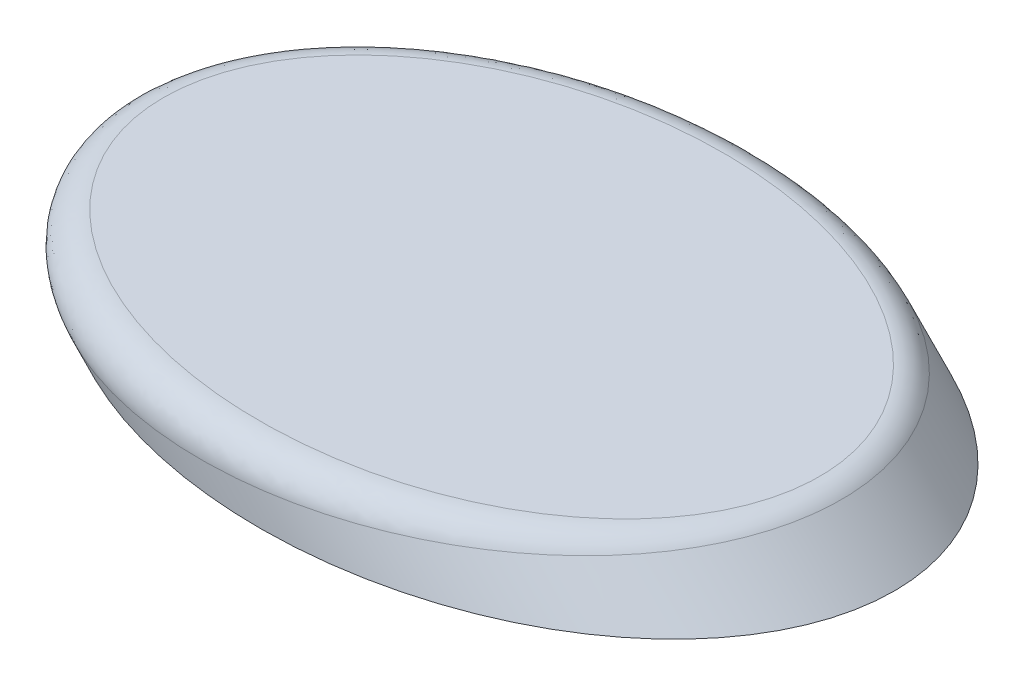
ISO-10303-21;
HEADER;
FILE_DESCRIPTION(('STEP AP214'),'2;1');
FILE_NAME('part.step','',(''),(''),'','','');
FILE_SCHEMA(('AUTOMOTIVE_DESIGN { 1 0 10303 214 1 1 1 1 }'));
ENDSEC;
DATA;
#1=APPLICATION_CONTEXT('core data for automotive mechanical design processes');
#2=APPLICATION_PROTOCOL_DEFINITION('international standard','automotive_design',2000,#1);
#3=PRODUCT_CONTEXT('',#1,'mechanical');
#4=PRODUCT('Part','Part','',(#3));
#5=PRODUCT_RELATED_PRODUCT_CATEGORY('part','',(#4));
#6=PRODUCT_DEFINITION_FORMATION('','',#4);
#7=PRODUCT_DEFINITION_CONTEXT('part definition',#1,'design');
#8=PRODUCT_DEFINITION('design','',#6,#7);
#9=PRODUCT_DEFINITION_SHAPE('','',#8);
#10=(LENGTH_UNIT() NAMED_UNIT(*) SI_UNIT(.MILLI.,.METRE.));
#11=(NAMED_UNIT(*) PLANE_ANGLE_UNIT() SI_UNIT($,.RADIAN.));
#12=(NAMED_UNIT(*) SI_UNIT($,.STERADIAN.) SOLID_ANGLE_UNIT());
#13=UNCERTAINTY_MEASURE_WITH_UNIT(LENGTH_MEASURE(1.E-05),#10,'distance_accuracy_value','');
#14=(GEOMETRIC_REPRESENTATION_CONTEXT(3) GLOBAL_UNCERTAINTY_ASSIGNED_CONTEXT((#13)) GLOBAL_UNIT_ASSIGNED_CONTEXT((#10,
#11,#12)) REPRESENTATION_CONTEXT('',''));
#15=CARTESIAN_POINT('',(0.,0.,0.));
#16=DIRECTION('',(0.,0.,1.));
#17=DIRECTION('',(1.,0.,0.));
#18=AXIS2_PLACEMENT_3D('',#15,#16,#17);
#19=CARTESIAN_POINT('',(0.,-6.35,0.));
#20=DIRECTION('',(0.,-1.,0.));
#21=DIRECTION('',(0.,0.,-1.));
#22=AXIS2_PLACEMENT_3D('',#19,#20,#21);
#23=PLANE('',#22);
#24=CARTESIAN_POINT('',(6.34999999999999,-6.35,0.));
#25=DIRECTION('',(0.,-1.,0.));
#26=DIRECTION('',(-1.,0.,0.));
#27=AXIS2_PLACEMENT_3D('',#24,#25,#26);
#28=ELLIPSE('',#27,38.1660885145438,26.9875);
#29=CARTESIAN_POINT('',(-31.8160885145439,-6.35,0.));
#30=VERTEX_POINT('',#29);
#31=EDGE_CURVE('E44',#30,#30,#28,.T.);
#32=ORIENTED_EDGE('',*,*,#31,.T.);
#33=EDGE_LOOP('',(#32));
#34=FACE_BOUND('',#33,.T.);
#35=ADVANCED_FACE('F31',(#34),#23,.T.);
#36=CARTESIAN_POINT('',(41.2749999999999,-41.275,0.));
#37=DIRECTION('',(-0.707106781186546,0.707106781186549,0.));
#38=DIRECTION('',(-0.707106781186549,-0.707106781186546,0.));
#39=AXIS2_PLACEMENT_3D('',#36,#37,#38);
#40=CYLINDRICAL_SURFACE('',#39,26.9875);
#41=CARTESIAN_POINT('',(3.175,-3.175,0.));
#42=DIRECTION('',(-0.0623782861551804,0.998052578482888,0.));
#43=DIRECTION('',(-0.998052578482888,-0.0623782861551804,0.));
#44=AXIS2_PLACEMENT_3D('',#41,#42,#43);
#45=ELLIPSE('',#44,35.9911143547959,26.9875);
#46=CARTESIAN_POINT('',(-32.7460244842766,-5.42006403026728,0.));
#47=VERTEX_POINT('',#46);
#48=EDGE_CURVE('E40',#47,#47,#45,.F.);
#49=ORIENTED_EDGE('',*,*,#48,.T.);
#50=EDGE_LOOP('',(#49));
#51=FACE_BOUND('',#50,.T.);
#52=ORIENTED_EDGE('',*,*,#31,.F.);
#53=EDGE_LOOP('',(#52));
#54=FACE_BOUND('',#53,.T.);
#55=ADVANCED_FACE('F51',(#51,#54),#40,.T.);
#56=CARTESIAN_POINT('',(0.,0.,0.));
#57=DIRECTION('',(0.,-1.,0.));
#58=DIRECTION('',(0.,0.,-1.));
#59=AXIS2_PLACEMENT_3D('',#56,#57,#58);
#60=PLANE('',#59);
#61=CARTESIAN_POINT('',(3.175,0.,0.));
#62=DIRECTION('',(0.,-1.,0.));
#63=DIRECTION('',(-1.,0.,0.));
#64=AXIS2_PLACEMENT_3D('',#61,#62,#63);
#65=ELLIPSE('',#64,33.6759604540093,23.8125);
#66=CARTESIAN_POINT('',(-30.5009604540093,0.,0.));
#67=VERTEX_POINT('',#66);
#68=EDGE_CURVE('E11',#67,#67,#65,.F.);
#69=ORIENTED_EDGE('',*,*,#68,.T.);
#70=EDGE_LOOP('',(#69));
#71=FACE_BOUND('',#70,.T.);
#72=ADVANCED_FACE('F53',(#71),#60,.F.);
#73=CARTESIAN_POINT('',(-30.5009604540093,0.,0.));
#74=CARTESIAN_POINT('',(-32.6224276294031,0.,0.));
#75=CARTESIAN_POINT('',(-33.4342779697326,-1.95998010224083,0.));
#76=CARTESIAN_POINT('',(-34.2461283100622,-3.91996020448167,0.));
#77=CARTESIAN_POINT('',(-32.7460244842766,-5.42006403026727,0.));
#78=CARTESIAN_POINT('',(-30.5009604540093,0.,-0.520980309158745));
#79=CARTESIAN_POINT('',(-32.6224276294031,0.,-0.586619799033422));
#80=CARTESIAN_POINT('',(-33.4342779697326,-1.95998010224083,-0.61173825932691));
#81=CARTESIAN_POINT('',(-34.2461283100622,-3.91996020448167,-0.636858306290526));
#82=CARTESIAN_POINT('',(-32.7460244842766,-5.42006403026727,-0.590444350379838));
#83=CARTESIAN_POINT('',(-30.4767371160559,0.,-1.04196061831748));
#84=CARTESIAN_POINT('',(-32.594325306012,0.,-1.17309843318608));
#85=CARTESIAN_POINT('',(-33.4053822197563,-1.95892374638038,-1.22347651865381));
#86=CARTESIAN_POINT('',(-34.2164669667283,-3.91784851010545,-1.27356335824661));
#87=CARTESIAN_POINT('',(-32.7201862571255,-5.41844914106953,-1.18088870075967));
#88=CARTESIAN_POINT('',(-30.3803663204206,0.,-2.07945714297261));
#89=CARTESIAN_POINT('',(-32.4826425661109,0.,-2.3400200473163));
#90=CARTESIAN_POINT('',(-33.2906069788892,-1.95473751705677,-2.4403125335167));
#91=CARTESIAN_POINT('',(-34.0985982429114,-3.90947601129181,-2.54031650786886));
#92=CARTESIAN_POINT('',(-32.6173907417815,-5.41202442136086,-2.35671809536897));
#93=CARTESIAN_POINT('',(-30.3082180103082,0.,-2.59597327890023));
#94=CARTESIAN_POINT('',(-32.399113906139,0.,-2.92019072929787));
#95=CARTESIAN_POINT('',(-33.2047264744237,-1.95160760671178,-3.04541017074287));
#96=CARTESIAN_POINT('',(-34.0104454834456,-3.90321908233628,-3.17006906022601));
#97=CARTESIAN_POINT('',(-32.5404325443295,-5.40721453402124,-2.94210304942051));
#98=CARTESIAN_POINT('',(-30.1159168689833,0.,-3.62882826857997));
#99=CARTESIAN_POINT('',(-32.1769284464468,0.,-4.07814235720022));
#100=CARTESIAN_POINT('',(-32.9764059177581,-1.94331776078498,-4.25274614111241));
#101=CARTESIAN_POINT('',(-33.7759919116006,-3.88663945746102,-4.42677373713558));
#102=CARTESIAN_POINT('',(-32.3353113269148,-5.3943944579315,-4.11267203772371));
#103=CARTESIAN_POINT('',(-29.9949879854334,0.,-4.1450222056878));
#104=CARTESIAN_POINT('',(-32.0374817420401,0.,-4.65547930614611));
#105=CARTESIAN_POINT('',(-32.8330517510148,-1.9381250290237,-4.8547707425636));
#106=CARTESIAN_POINT('',(-33.6288579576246,-3.87625857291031,-5.05324074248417));
#107=CARTESIAN_POINT('',(-32.2063205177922,-5.38633253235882,-4.69769183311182));
#108=CARTESIAN_POINT('',(-29.7076069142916,0.,-5.164541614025));
#109=CARTESIAN_POINT('',(-31.7070299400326,0.,-5.79258191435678));
#110=CARTESIAN_POINT('',(-32.4935260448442,-1.92589077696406,-6.04010029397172));
#111=CARTESIAN_POINT('',(-33.2802560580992,-3.85178997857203,-6.2867989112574));
#112=CARTESIAN_POINT('',(-31.8997807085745,-5.36717379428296,-5.85314716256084));
#113=CARTESIAN_POINT('',(-29.5411526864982,0.,-5.66786650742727));
#114=CARTESIAN_POINT('',(-31.5161623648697,0.,-6.35213521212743));
#115=CARTESIAN_POINT('',(-32.2973521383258,-1.91884917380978,-6.62340440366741));
#116=CARTESIAN_POINT('',(-33.0789331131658,-3.83771230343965,-6.89366011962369));
#117=CARTESIAN_POINT('',(-31.7222295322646,-5.35607684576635,-6.42358204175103));
#118=CARTESIAN_POINT('',(-29.1600292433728,0.,-6.67363826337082));
#119=CARTESIAN_POINT('',(-31.0806351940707,0.,-7.46637156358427));
#120=CARTESIAN_POINT('',(-31.8499402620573,-1.90289387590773,-7.78457186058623));
#121=CARTESIAN_POINT('',(-32.6196583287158,-3.80580247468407,-8.10169844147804));
#122=CARTESIAN_POINT('',(-31.3156978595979,-5.33066861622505,-7.56345669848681));
#123=CARTESIAN_POINT('',(-28.9440333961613,0.,-7.17558101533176));
#124=CARTESIAN_POINT('',(-30.8346620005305,0.,-8.02023287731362));
#125=CARTESIAN_POINT('',(-31.5971929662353,-1.89392921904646,-8.36171481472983));
#126=CARTESIAN_POINT('',(-32.3603240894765,-3.78787955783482,-8.70197278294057));
#127=CARTESIAN_POINT('',(-31.0853022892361,-5.31626889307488,-8.13232515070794));
#128=CARTESIAN_POINT('',(-28.4707577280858,0.,-8.15955287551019));
#129=CARTESIAN_POINT('',(-30.2977851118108,0.,-9.10160371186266));
#130=CARTESIAN_POINT('',(-31.045818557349,-1.87452682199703,-9.48814415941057));
#131=CARTESIAN_POINT('',(-31.7944496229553,-3.74907467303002,-9.87346158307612));
#132=CARTESIAN_POINT('',(-30.5804749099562,-5.28471718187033,-9.24749325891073));
#133=CARTESIAN_POINT('',(-28.2134756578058,0.,-8.64158089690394));
#134=CARTESIAN_POINT('',(-30.0070627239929,0.,-9.62899497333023));
#135=CARTESIAN_POINT('',(-30.7471889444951,-1.86408900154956,-10.0374290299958));
#136=CARTESIAN_POINT('',(-31.4881001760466,-3.72820520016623,-10.4445490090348));
#137=CARTESIAN_POINT('',(-30.3060407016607,-5.26756504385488,-9.79379168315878));
#138=CARTESIAN_POINT('',(-27.6503847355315,0.,-9.60283857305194));
#139=CARTESIAN_POINT('',(-29.3733750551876,0.,-10.6761423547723));
#140=CARTESIAN_POINT('',(-30.096549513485,-1.84154912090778,-11.1277223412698));
#141=CARTESIAN_POINT('',(-30.8205700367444,-3.68312754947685,-11.5778831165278));
#142=CARTESIAN_POINT('',(-29.7054103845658,-5.23002564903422,-10.8832170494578));
#143=CARTESIAN_POINT('',(-27.3430300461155,0.,-10.0811604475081));
#144=CARTESIAN_POINT('',(-29.0289322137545,0.,-11.1947031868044));
#145=CARTESIAN_POINT('',(-29.7428649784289,-1.82939670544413,-11.6674898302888));
#146=CARTESIAN_POINT('',(-30.4578406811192,-3.65882888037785,-12.1388137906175));
#147=CARTESIAN_POINT('',(-29.3775653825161,-5.20953533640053,-11.4253151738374));
#148=CARTESIAN_POINT('',(-26.6921881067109,0.,-11.0127566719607));
#149=CARTESIAN_POINT('',(-28.3025978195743,0.,-12.2000505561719));
#150=CARTESIAN_POINT('',(-28.9973940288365,-1.80404073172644,-12.7135808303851));
#151=CARTESIAN_POINT('',(-29.6932321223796,-3.60811690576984,-13.2256482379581));
#152=CARTESIAN_POINT('',(-28.6833339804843,-5.16614587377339,-12.4811242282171));
#153=CARTESIAN_POINT('',(-26.3486848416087,0.,-11.4660197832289));
#154=CARTESIAN_POINT('',(-27.9208726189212,0.,-12.6868030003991));
#155=CARTESIAN_POINT('',(-28.6055907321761,-1.79083670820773,-13.2198893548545));
#156=CARTESIAN_POINT('',(-29.2915273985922,-3.58171404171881,-13.7515167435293));
#157=CARTESIAN_POINT('',(-28.3169304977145,-5.14324565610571,-12.9948224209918));
#158=CARTESIAN_POINT('',(-25.6132999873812,0.,-12.3666757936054));
#159=CARTESIAN_POINT('',(-27.1070081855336,0.,-13.6495395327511));
#160=CARTESIAN_POINT('',(-27.7705455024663,-1.76299682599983,-14.2210234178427));
#161=CARTESIAN_POINT('',(-28.4354071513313,-3.52603780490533,-14.7909175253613));
#162=CARTESIAN_POINT('',(-27.5325199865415,-5.09421999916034,-14.0155658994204));
#163=CARTESIAN_POINT('',(-25.2199219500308,0.,-12.8128454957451));
#164=CARTESIAN_POINT('',(-26.6734809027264,0.,-14.1240955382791));
#165=CARTESIAN_POINT('',(-27.3257683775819,-1.74832306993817,-14.714256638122));
#166=CARTESIAN_POINT('',(-27.9795454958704,-3.49669469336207,-15.3028770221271));
#167=CARTESIAN_POINT('',(-27.1129167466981,-5.06799479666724,-14.5212248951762));
#168=CARTESIAN_POINT('',(-24.4028107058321,0.,-13.6761564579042));
#169=CARTESIAN_POINT('',(-25.7765428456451,0.,-15.0380646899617));
#170=CARTESIAN_POINT('',(-26.4059261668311,-1.71833021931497,-15.6638639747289));
#171=CARTESIAN_POINT('',(-27.0368077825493,-3.43670931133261,-16.2881193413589));
#172=CARTESIAN_POINT('',(-26.2413314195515,-5.01352071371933,-15.4996439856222));
#173=CARTESIAN_POINT('',(-23.9790793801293,0.,-14.0932995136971));
#174=CARTESIAN_POINT('',(-25.3132863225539,0.,-15.4775370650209));
#175=CARTESIAN_POINT('',(-25.9308629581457,-1.70301116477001,-16.1202403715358));
#176=CARTESIAN_POINT('',(-26.5500925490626,-3.4060750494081,-16.7614686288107));
#177=CARTESIAN_POINT('',(-25.7893513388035,-4.98527195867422,-15.9724061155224));
#178=CARTESIAN_POINT('',(-22.6270452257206,0.,-15.3392117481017));
#179=CARTESIAN_POINT('',(-23.8432069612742,0.,-16.7819268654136));
#180=CARTESIAN_POINT('',(-24.4212041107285,-1.65491855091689,-17.4767569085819));
#181=CARTESIAN_POINT('',(-25.0062598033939,-3.31006183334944,-18.1652231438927));
#182=CARTESIAN_POINT('',(-24.3471815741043,-4.89513634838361,-17.384439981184));
#183=CARTESIAN_POINT('',(-21.6534065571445,0.,-16.1196073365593));
#184=CARTESIAN_POINT('',(-22.7908790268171,0.,-17.5924116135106));
#185=CARTESIAN_POINT('',(-23.3425172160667,-1.62136623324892,-18.3167860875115));
#186=CARTESIAN_POINT('',(-23.9020788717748,-3.24297230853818,-19.0357179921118));
#187=CARTESIAN_POINT('',(-23.3086336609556,-4.83022710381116,-18.2688883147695));
#188=CARTESIAN_POINT('',(-20.1066976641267,0.,-17.2133238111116));
#189=CARTESIAN_POINT('',(-21.1267729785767,0.,-18.7204277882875));
#190=CARTESIAN_POINT('',(-21.6411069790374,-1.56980518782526,-19.483407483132));
#191=CARTESIAN_POINT('',(-22.1576332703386,-3.13967695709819,-20.2448889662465));
#192=CARTESIAN_POINT('',(-21.6588108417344,-4.72711317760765,-19.508433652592));
#193=CARTESIAN_POINT('',(-19.5643563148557,0.,-17.5717353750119));
#194=CARTESIAN_POINT('',(-20.5461775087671,0.,-19.0877456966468));
#195=CARTESIAN_POINT('',(-21.0466133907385,-1.55202467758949,-19.8636314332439));
#196=CARTESIAN_POINT('',(-21.5492911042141,-3.10411557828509,-20.6381743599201));
#197=CARTESIAN_POINT('',(-21.0803134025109,-4.69095708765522,-19.9146334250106));
#198=CARTESIAN_POINT('',(-18.4594481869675,0.,-18.2559545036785));
#199=CARTESIAN_POINT('',(-19.3668072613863,0.,-19.7858021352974));
#200=CARTESIAN_POINT('',(-19.8393621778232,-1.51639114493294,-20.5859284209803));
#201=CARTESIAN_POINT('',(-20.3141416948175,-3.03284789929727,-21.3847252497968));
#202=CARTESIAN_POINT('',(-19.9017447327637,-4.61729654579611,-20.6900817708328));
#203=CARTESIAN_POINT('',(-17.896882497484,0.,-18.5817638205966));
#204=CARTESIAN_POINT('',(-18.768097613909,0.,-20.1166791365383));
#205=CARTESIAN_POINT('',(-19.2266055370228,-1.49853812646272,-20.9280035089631));
#206=CARTESIAN_POINT('',(-19.6874005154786,-2.99714196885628,-21.7381421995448));
#207=CARTESIAN_POINT('',(-19.3016746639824,-4.57979216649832,-21.0593323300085));
#208=CARTESIAN_POINT('',(-16.1384770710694,0.,-19.5358706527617));
#209=CARTESIAN_POINT('',(-16.9052438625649,0.,-21.0793811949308));
#210=CARTESIAN_POINT('',(-17.3168565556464,-1.44362046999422,-21.9248179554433));
#211=CARTESIAN_POINT('',(-17.7382293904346,-2.88752171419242,-22.7651436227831));
#212=CARTESIAN_POINT('',(-17.426042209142,-4.46256513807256,-22.1406534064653));
#213=CARTESIAN_POINT('',(-14.9137949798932,0.,-20.1115784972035));
#214=CARTESIAN_POINT('',(-15.612220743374,0.,-21.6559134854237));
#215=CARTESIAN_POINT('',(-15.9944190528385,-1.40659502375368,-22.5190318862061));
#216=CARTESIAN_POINT('',(-16.3865296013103,-2.81346032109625,-23.3783016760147));
#217=CARTESIAN_POINT('',(-16.1197146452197,-4.38091966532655,-22.7931222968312));
#218=CARTESIAN_POINT('',(-12.3710430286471,0.,-21.1496698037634));
#219=CARTESIAN_POINT('',(-12.9393079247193,0.,-22.6847436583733));
#220=CARTESIAN_POINT('',(-13.2618041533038,-1.3320509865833,-23.5789789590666));
#221=CARTESIAN_POINT('',(-13.5948422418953,-2.66438967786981,-24.4691290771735));
#222=CARTESIAN_POINT('',(-13.4074458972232,-4.21140286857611,-23.9696257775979));
#223=CARTESIAN_POINT('',(-11.0512266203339,0.,-21.6077052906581));
#224=CARTESIAN_POINT('',(-11.5576560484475,0.,-23.1337001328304));
#225=CARTESIAN_POINT('',(-11.8501715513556,-1.29455620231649,-24.0398458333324));
#226=CARTESIAN_POINT('',(-12.1530763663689,-2.58938149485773,-24.9431596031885));
#227=CARTESIAN_POINT('',(-11.999641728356,-4.12341510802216,-24.4887326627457));
#228=CARTESIAN_POINT('',(-8.33941923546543,0.,-22.4019624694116));
#229=CARTESIAN_POINT('',(-8.72891856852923,0.,-23.9012061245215));
#230=CARTESIAN_POINT('',(-8.96091750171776,-1.21971516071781,-24.8269849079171));
#231=CARTESIAN_POINT('',(-9.20375895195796,-2.43971120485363,-25.749811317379));
#232=CARTESIAN_POINT('',(-9.10704718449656,-3.94262794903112,-25.3888907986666));
#233=CARTESIAN_POINT('',(-6.94644728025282,0.,-22.7348153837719));
#234=CARTESIAN_POINT('',(-7.28059878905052,0.,-24.2174369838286));
#235=CARTESIAN_POINT('',(-7.48252987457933,-1.1823965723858,-25.1495637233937));
#236=CARTESIAN_POINT('',(-7.69496427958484,-2.36505200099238,-26.0799176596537));
#237=CARTESIAN_POINT('',(-7.6212104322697,-3.84976315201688,-25.7661241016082));
#238=CARTESIAN_POINT('',(-4.11153658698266,0.,-23.2719448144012));
#239=CARTESIAN_POINT('',(-4.34158919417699,0.,-24.7146066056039));
#240=CARTESIAN_POINT('',(-4.48320671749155,-1.10847045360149,-25.6553134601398));
#241=CARTESIAN_POINT('',(-4.6356234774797,-2.21720710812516,-26.5942010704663));
#242=CARTESIAN_POINT('',(-4.59730569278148,-3.66076910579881,-26.3748707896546));
#243=CARTESIAN_POINT('',(-2.6691678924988,0.,-23.4739310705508));
#244=CARTESIAN_POINT('',(-2.85004762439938,0.,-24.8942775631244));
#245=CARTESIAN_POINT('',(-2.96197558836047,-1.07188591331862,-25.83601233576));
#246=CARTESIAN_POINT('',(-3.08421404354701,-2.14401429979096,-26.7770074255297));
#247=CARTESIAN_POINT('',(-3.05877908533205,-3.56461119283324,-26.6037885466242));
#248=CARTESIAN_POINT('',(0.240396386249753,0.,-23.7447864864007));
#249=CARTESIAN_POINT('',(0.151610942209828,0.,-25.1152596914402));
#250=CARTESIAN_POINT('',(0.0988697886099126,-0.999904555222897,-26.0550469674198));
#251=CARTESIAN_POINT('',(0.0357087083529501,-2.00005415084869,-26.9940904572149));
#252=CARTESIAN_POINT('',(0.0447561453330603,-3.37064024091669,-26.9107580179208));
#253=CARTESIAN_POINT('',(1.70769880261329,0.,-23.8124996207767));
#254=CARTESIAN_POINT('',(1.66235509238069,0.,-25.1563701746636));
#255=CARTESIAN_POINT('',(1.63852983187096,-0.964520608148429,-26.0921489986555));
#256=CARTESIAN_POINT('',(1.60486999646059,-1.92926259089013,-27.0281477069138));
#257=CARTESIAN_POINT('',(1.6098787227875,-3.27282007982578,-26.9874995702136));
#258=CARTESIAN_POINT('',(4.6423011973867,0.,-23.8125003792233));
#259=CARTESIAN_POINT('',(4.67802363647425,0.,-25.0990687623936));
#260=CARTESIAN_POINT('',(4.71147016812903,-0.895351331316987,-26.0229790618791));
#261=CARTESIAN_POINT('',(4.73514309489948,-1.79092265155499,-26.9471108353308));
#262=CARTESIAN_POINT('',(4.74012127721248,-3.07717992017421,-26.9875004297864));
#263=CARTESIAN_POINT('',(6.10960117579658,0.,-23.7447880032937));
#264=CARTESIAN_POINT('',(6.18351833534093,0.,-25.0015314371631));
#265=CARTESIAN_POINT('',(6.24475046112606,-0.861566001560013,-25.9167070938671));
#266=CARTESIAN_POINT('',(6.2968596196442,-1.72332923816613,-26.8329481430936));
#267=CARTESIAN_POINT('',(6.30524125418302,-2.97935992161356,-26.9107597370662));
#268=CARTESIAN_POINT('',(9.0191703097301,0.,-23.4739295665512));
#269=CARTESIAN_POINT('',(9.16411153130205,0.,-24.6678080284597));
#270=CARTESIAN_POINT('',(9.28001017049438,-0.795948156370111,-25.5618543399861));
#271=CARTESIAN_POINT('',(9.38699460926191,-1.59208901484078,-26.4569439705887));
#272=CARTESIAN_POINT('',(9.40878166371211,-2.78538864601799,-26.6037868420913));
#273=CARTESIAN_POINT('',(10.4615462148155,0.,-23.2719395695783));
#274=CARTESIAN_POINT('',(10.6399068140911,0.,-24.4335713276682));
#275=CARTESIAN_POINT('',(10.7821448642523,-0.764101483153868,-25.3144908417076));
#276=CARTESIAN_POINT('',(10.9161609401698,-1.52837429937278,-26.1971770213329));
#277=CARTESIAN_POINT('',(10.9473159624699,-2.68923025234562,-26.3748648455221));
#278=CARTESIAN_POINT('',(13.2964378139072,0.,-22.7348205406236));
#279=CARTESIAN_POINT('',(13.5366987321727,0.,-23.8294223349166));
#280=CARTESIAN_POINT('',(13.7303991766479,-0.702668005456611,-24.680652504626));
#281=CARTESIAN_POINT('',(13.9161962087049,-1.40550068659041,-25.5335827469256));
#282=CARTESIAN_POINT('',(13.9712003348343,-2.50023747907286,-25.7661299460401));
#283=CARTESIAN_POINT('',(14.6893840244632,0.,-22.4019814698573));
#284=CARTESIAN_POINT('',(14.9587227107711,0.,-23.4625162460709));
#285=CARTESIAN_POINT('',(15.1770357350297,-0.673052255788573,-24.2965805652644));
#286=CARTESIAN_POINT('',(15.3881629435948,-1.34624936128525,-25.132948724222));
#287=CARTESIAN_POINT('',(15.457009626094,-2.40737439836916,-25.3889123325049));
#288=CARTESIAN_POINT('',(17.4012609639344,0.,-21.6076867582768));
#289=CARTESIAN_POINT('',(17.7241990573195,0.,-22.5980719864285));
#290=CARTESIAN_POINT('',(17.9902475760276,-0.616346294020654,-23.3946181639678));
#291=CARTESIAN_POINT('',(18.2494986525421,-1.23282959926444,-24.1933437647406));
#292=CARTESIAN_POINT('',(18.34967836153,-2.22658260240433,-24.4887116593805));
#293=CARTESIAN_POINT('',(18.7211697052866,0.,-21.1496014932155));
#294=CARTESIAN_POINT('',(19.0692321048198,0.,-22.1045461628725));
#295=CARTESIAN_POINT('',(19.3579172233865,-0.589211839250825,-22.8802573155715));
#296=CARTESIAN_POINT('',(19.6405409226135,-1.17854231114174,-23.6586279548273));
#297=CARTESIAN_POINT('',(19.7575810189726,-2.13858868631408,-23.9695483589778));
#298=CARTESIAN_POINT('',(21.2636723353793,0.,-20.1116446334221));
#299=CARTESIAN_POINT('',(21.6577409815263,0.,-20.9941128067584));
#300=CARTESIAN_POINT('',(21.9899841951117,-0.537702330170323,-21.7252301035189));
#301=CARTESIAN_POINT('',(22.3165704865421,-1.07551535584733,-22.4588302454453));
#302=CARTESIAN_POINT('',(22.4695838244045,-1.96908851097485,-22.7931972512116));
#303=CARTESIAN_POINT('',(22.4880264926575,0.,-19.5361136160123));
#304=CARTESIAN_POINT('',(22.9035943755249,0.,-20.382108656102));
#305=CARTESIAN_POINT('',(23.2562830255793,-0.513266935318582,-21.089105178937));
#306=CARTESIAN_POINT('',(23.6040534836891,-1.02662764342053,-21.7989418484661));
#307=CARTESIAN_POINT('',(23.7755615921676,-1.88746490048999,-22.1409287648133));
#308=CARTESIAN_POINT('',(24.8181040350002,0.,-18.2718217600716));
#309=CARTESIAN_POINT('',(25.2727072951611,0.,-19.0435881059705));
#310=CARTESIAN_POINT('',(25.6643803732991,-0.467347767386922,-19.6996848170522));
#311=CARTESIAN_POINT('',(26.0515319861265,-0.93478176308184,-20.3583879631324));
#312=CARTESIAN_POINT('',(26.260977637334,-1.73212639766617,-20.7080646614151));
#313=CARTESIAN_POINT('',(25.926567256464,0.,-17.5881937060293));
#314=CARTESIAN_POINT('',(26.399341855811,0.,-18.3226789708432));
#315=CARTESIAN_POINT('',(26.8090811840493,-0.445787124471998,-18.9517593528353));
#316=CARTESIAN_POINT('',(27.2150484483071,-0.891644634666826,-19.5836564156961));
#317=CARTESIAN_POINT('',(27.4433384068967,-1.65822884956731,-19.9332862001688));
#318=CARTESIAN_POINT('',(27.4956166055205,0.,-16.4786775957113));
#319=CARTESIAN_POINT('',(27.9942867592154,0.,-17.1551760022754));
#320=CARTESIAN_POINT('',(28.4284580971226,-0.415590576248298,-17.7425966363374));
#321=CARTESIAN_POINT('',(28.8617607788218,-0.831197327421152,-18.3306658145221));
#322=CARTESIAN_POINT('',(29.1169910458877,-1.5536255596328,-18.6758346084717));
#323=CARTESIAN_POINT('',(27.9928307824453,0.,-16.1041017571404));
#324=CARTESIAN_POINT('',(28.4991811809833,0.,-16.7619081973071));
#325=CARTESIAN_POINT('',(28.9414637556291,-0.406073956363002,-17.3350450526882));
#326=CARTESIAN_POINT('',(29.3829708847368,-0.81216223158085,-17.9088382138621));
#327=CARTESIAN_POINT('',(29.647352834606,-1.52047794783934,-18.2513153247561));
#328=CARTESIAN_POINT('',(28.9621053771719,0.,-15.3237655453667));
#329=CARTESIAN_POINT('',(29.4831384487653,0.,-15.9436407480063));
#330=CARTESIAN_POINT('',(29.9412572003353,-0.387611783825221,-16.4872987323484));
#331=CARTESIAN_POINT('',(30.3986010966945,-0.77523787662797,-17.0316149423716));
#332=CARTESIAN_POINT('',(30.6812457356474,-1.45585964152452,-17.3669342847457));
#333=CARTESIAN_POINT('',(29.4341643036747,0.,-14.9180033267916));
#334=CARTESIAN_POINT('',(29.9622887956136,0.,-15.5186475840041));
#335=CARTESIAN_POINT('',(30.4280434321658,-0.378666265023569,-16.0471020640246));
#336=CARTESIAN_POINT('',(30.8931117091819,-0.757345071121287,-16.5762255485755));
#337=CARTESIAN_POINT('',(31.1847752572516,-1.42438904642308,-16.907070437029));
#338=CARTESIAN_POINT('',(30.7658460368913,0.,-13.6907555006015));
#339=CARTESIAN_POINT('',(31.312726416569,0.,-14.2354194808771));
#340=CARTESIAN_POINT('',(31.8009414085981,-0.353543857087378,-14.71745041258));
#341=CARTESIAN_POINT('',(32.2866841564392,-0.70713298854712,-15.2018675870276));
#342=CARTESIAN_POINT('',(32.6052357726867,-1.33561026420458,-15.5161895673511));
#343=CARTESIAN_POINT('',(31.5876856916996,0.,-12.8266683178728));
#344=CARTESIAN_POINT('',(32.1467012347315,0.,-13.3329393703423));
#345=CARTESIAN_POINT('',(32.6477916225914,-0.338185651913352,-13.7833647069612));
#346=CARTESIAN_POINT('',(33.1470956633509,-0.676403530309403,-14.2360767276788));
#347=CARTESIAN_POINT('',(33.4818647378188,-1.28082095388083,-14.53689076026));
#348=CARTESIAN_POINT('',(32.6987662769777,0.,-11.4659380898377));
#349=CARTESIAN_POINT('',(33.2741117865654,0.,-11.9131606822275));
#350=CARTESIAN_POINT('',(33.7922879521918,-0.317561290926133,-12.3152029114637));
#351=CARTESIAN_POINT('',(34.3100503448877,-0.635130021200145,-12.7177782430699));
#352=CARTESIAN_POINT('',(34.6670173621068,-1.20674891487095,-12.9947298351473));
#353=CARTESIAN_POINT('',(33.0422098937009,0.,-11.0127348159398));
#354=CARTESIAN_POINT('',(33.6223835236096,0.,-11.4408749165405));
#355=CARTESIAN_POINT('',(34.1459934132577,-0.311209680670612,-11.8266254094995));
#356=CARTESIAN_POINT('',(34.669269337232,-0.622425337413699,-12.2128767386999));
#357=CARTESIAN_POINT('',(35.03335721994,-1.18385267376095,-12.4810994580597));
#358=CARTESIAN_POINT('',(33.6930082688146,0.,-10.0811822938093));
#359=CARTESIAN_POINT('',(34.2821827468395,0.,-10.470711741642));
#360=CARTESIAN_POINT('',(34.8161361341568,-0.299209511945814,-10.8231123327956));
#361=CARTESIAN_POINT('',(35.349758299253,-0.598424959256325,-11.1760081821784));
#362=CARTESIAN_POINT('',(35.7275421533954,-1.1404661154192,-11.4253399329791));
#363=CARTESIAN_POINT('',(34.0003790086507,0.,-9.60284431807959));
#364=CARTESIAN_POINT('',(34.5938012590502,0.,-9.97281477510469));
#365=CARTESIAN_POINT('',(35.1325898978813,-0.293560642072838,-10.3081885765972));
#366=CARTESIAN_POINT('',(35.6711222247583,-0.587125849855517,-10.6440198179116));
#367=CARTESIAN_POINT('',(36.055404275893,-1.11997473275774,-10.8832235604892));
#368=CARTESIAN_POINT('',(34.563481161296,0.,-8.64157537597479));
#369=CARTESIAN_POINT('',(35.1645722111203,0.,-8.97276327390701));
#370=CARTESIAN_POINT('',(35.7122579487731,-0.283238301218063,-9.27404538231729));
#371=CARTESIAN_POINT('',(36.2597062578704,-0.566480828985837,-9.57575090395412));
#372=CARTESIAN_POINT('',(36.6560465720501,-1.08243458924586,-9.79378542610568));
#373=CARTESIAN_POINT('',(34.8207592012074,0.,-8.15955139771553));
#374=CARTESIAN_POINT('',(35.4253538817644,0.,-8.47150853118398));
#375=CARTESIAN_POINT('',(35.9770674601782,-0.278535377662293,-8.75577700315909));
#376=CARTESIAN_POINT('',(36.5286080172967,-0.557073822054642,-9.04042153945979));
#377=CARTESIAN_POINT('',(36.9304764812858,-1.06528271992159,-9.24749158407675));
#378=CARTESIAN_POINT('',(35.29403192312,0.,-7.17558249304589));
#379=CARTESIAN_POINT('',(35.9049769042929,0.,-7.44873384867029));
#380=CARTESIAN_POINT('',(36.4641452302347,-0.269901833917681,-7.69834388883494));
#381=CARTESIAN_POINT('',(37.0231405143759,-0.539806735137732,-7.9483291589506));
#382=CARTESIAN_POINT('',(37.4353007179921,-1.03373120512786,-8.13232682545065));
#383=CARTESIAN_POINT('',(35.5100288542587,0.,-6.67363865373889));
#384=CARTESIAN_POINT('',(36.1238809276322,0.,-6.9271641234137));
#385=CARTESIAN_POINT('',(36.6864158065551,-0.265971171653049,-7.15918029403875));
#386=CARTESIAN_POINT('',(37.2488358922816,-0.531944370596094,-7.39151282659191));
#387=CARTESIAN_POINT('',(37.6656974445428,-1.01933140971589,-7.56345714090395));
#388=CARTESIAN_POINT('',(35.8911530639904,0.,-5.66786612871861));
#389=CARTESIAN_POINT('',(36.5100644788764,0.,-5.88243904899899));
#390=CARTESIAN_POINT('',(37.0785788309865,-0.259046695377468,-6.07924916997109));
#391=CARTESIAN_POINT('',(37.6469848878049,-0.518095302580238,-6.27635727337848));
#392=CARTESIAN_POINT('',(38.0722299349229,-0.993923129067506,-6.42358161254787));
#393=CARTESIAN_POINT('',(36.057607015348,0.,-5.16454151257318));
#394=CARTESIAN_POINT('',(36.678736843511,0.,-5.35974702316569));
#395=CARTESIAN_POINT('',(37.2498374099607,-0.256028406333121,-5.53901052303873));
#396=CARTESIAN_POINT('',(37.8208750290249,-0.512057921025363,-5.71850752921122));
#397=CARTESIAN_POINT('',(38.2497808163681,-0.982826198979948,-5.85314704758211));
#398=CARTESIAN_POINT('',(36.3449878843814,0.,-4.14502230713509));
#399=CARTESIAN_POINT('',(36.9698970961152,0.,-4.30129791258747));
#400=CARTESIAN_POINT('',(37.5454971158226,-0.250823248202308,-4.44502679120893));
#401=CARTESIAN_POINT('',(38.1210338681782,-0.501647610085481,-4.58898917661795));
#402=CARTESIAN_POINT('',(38.5563204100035,-0.963667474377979,-4.69769194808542));
#403=CARTESIAN_POINT('',(36.465916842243,0.,-3.62882829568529));
#404=CARTESIAN_POINT('',(37.0924266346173,0.,-3.76547473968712));
#405=CARTESIAN_POINT('',(37.6699003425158,-0.248636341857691,-3.89128231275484));
#406=CARTESIAN_POINT('',(38.2473455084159,-0.497273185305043,-4.01724998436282));
#407=CARTESIAN_POINT('',(38.6853112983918,-0.955605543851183,-4.11267206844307));
#408=CARTESIAN_POINT('',(36.6582180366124,0.,-2.59597325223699));
#409=CARTESIAN_POINT('',(37.2872414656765,0.,-2.69357057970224));
#410=CARTESIAN_POINT('',(37.8677197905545,-0.245161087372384,-2.78349785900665));
#411=CARTESIAN_POINT('',(38.4481703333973,-0.490322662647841,-2.87358045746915));
#412=CARTESIAN_POINT('',(38.8904325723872,-0.942785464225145,-2.94210301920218));
#413=CARTESIAN_POINT('',(36.7303663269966,0.,-2.0794571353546));
#414=CARTESIAN_POINT('',(37.3603400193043,0.,-2.1575673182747));
#415=CARTESIAN_POINT('',(37.9419344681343,-0.24385866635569,-2.22960998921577));
#416=CARTESIAN_POINT('',(38.5235219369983,-0.487717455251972,-2.30173167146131));
#417=CARTESIAN_POINT('',(38.9673907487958,-0.937975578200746,-2.35671808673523));
#418=CARTESIAN_POINT('',(36.82673710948,0.,-1.04196062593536));
#419=CARTESIAN_POINT('',(37.4579655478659,0.,-1.08108019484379));
#420=CARTESIAN_POINT('',(38.0410643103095,-0.242119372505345,-1.11714802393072));
#421=CARTESIAN_POINT('',(38.6241559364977,-0.484238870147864,-1.15329525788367));
#422=CARTESIAN_POINT('',(39.0701862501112,-0.931550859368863,-1.18088870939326));
#423=CARTESIAN_POINT('',(36.8509604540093,0.,-0.520980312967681));
#424=CARTESIAN_POINT('',(37.4825072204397,0.,-0.540520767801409));
#425=CARTESIAN_POINT('',(38.0659803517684,-0.241682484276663,-0.558574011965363));
#426=CARTESIAN_POINT('',(38.6494534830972,-0.483364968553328,-0.576627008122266));
#427=CARTESIAN_POINT('',(39.0960244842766,-0.929935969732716,-0.590444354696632));
#428=CARTESIAN_POINT('',(36.8509604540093,0.,0.520980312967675));
#429=CARTESIAN_POINT('',(37.4825072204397,0.,0.540520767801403));
#430=CARTESIAN_POINT('',(38.0659803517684,-0.241682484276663,0.558574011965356));
#431=CARTESIAN_POINT('',(38.6494534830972,-0.483364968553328,0.576627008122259));
#432=CARTESIAN_POINT('',(39.0960244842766,-0.929935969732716,0.590444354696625));
#433=CARTESIAN_POINT('',(36.82673710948,0.,1.04196062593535));
#434=CARTESIAN_POINT('',(37.4579655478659,0.,1.08108019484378));
#435=CARTESIAN_POINT('',(38.0410643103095,-0.242119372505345,1.11714802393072));
#436=CARTESIAN_POINT('',(38.6241559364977,-0.484238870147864,1.15329525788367));
#437=CARTESIAN_POINT('',(39.0701862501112,-0.931550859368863,1.18088870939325));
#438=CARTESIAN_POINT('',(36.7303663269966,0.,2.07945713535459));
#439=CARTESIAN_POINT('',(37.3603400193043,0.,2.1575673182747));
#440=CARTESIAN_POINT('',(37.9419344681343,-0.24385866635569,2.22960998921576));
#441=CARTESIAN_POINT('',(38.5235219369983,-0.487717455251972,2.30173167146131));
#442=CARTESIAN_POINT('',(38.9673907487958,-0.937975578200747,2.35671808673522));
#443=CARTESIAN_POINT('',(36.6582180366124,0.,2.59597325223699));
#444=CARTESIAN_POINT('',(37.2872414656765,0.,2.69357057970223));
#445=CARTESIAN_POINT('',(37.8677197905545,-0.245161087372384,2.78349785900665));
#446=CARTESIAN_POINT('',(38.4481703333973,-0.490322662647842,2.87358045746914));
#447=CARTESIAN_POINT('',(38.8904325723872,-0.942785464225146,2.94210301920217));
#448=CARTESIAN_POINT('',(36.465916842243,0.,3.62882829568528));
#449=CARTESIAN_POINT('',(37.0924266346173,0.,3.76547473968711));
#450=CARTESIAN_POINT('',(37.6699003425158,-0.248636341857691,3.89128231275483));
#451=CARTESIAN_POINT('',(38.2473455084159,-0.497273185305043,4.01724998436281));
#452=CARTESIAN_POINT('',(38.6853112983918,-0.955605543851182,4.11267206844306));
#453=CARTESIAN_POINT('',(36.3449878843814,0.,4.14502230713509));
#454=CARTESIAN_POINT('',(36.9698970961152,0.,4.30129791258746));
#455=CARTESIAN_POINT('',(37.5454971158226,-0.250823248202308,4.44502679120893));
#456=CARTESIAN_POINT('',(38.1210338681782,-0.50164761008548,4.58898917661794));
#457=CARTESIAN_POINT('',(38.5563204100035,-0.963667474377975,4.69769194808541));
#458=CARTESIAN_POINT('',(36.057607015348,0.,5.16454151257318));
#459=CARTESIAN_POINT('',(36.678736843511,0.,5.35974702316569));
#460=CARTESIAN_POINT('',(37.2498374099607,-0.25602840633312,5.53901052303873));
#461=CARTESIAN_POINT('',(37.8208750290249,-0.512057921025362,5.71850752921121));
#462=CARTESIAN_POINT('',(38.2497808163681,-0.982826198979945,5.8531470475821));
#463=CARTESIAN_POINT('',(35.8911530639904,0.,5.6678661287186));
#464=CARTESIAN_POINT('',(36.5100644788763,0.,5.88243904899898));
#465=CARTESIAN_POINT('',(37.0785788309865,-0.259046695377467,6.07924916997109));
#466=CARTESIAN_POINT('',(37.6469848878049,-0.518095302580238,6.27635727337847));
#467=CARTESIAN_POINT('',(38.0722299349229,-0.993923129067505,6.42358161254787));
#468=CARTESIAN_POINT('',(35.5100288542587,0.,6.67363865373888));
#469=CARTESIAN_POINT('',(36.1238809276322,0.,6.92716412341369));
#470=CARTESIAN_POINT('',(36.6864158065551,-0.265971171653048,7.15918029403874));
#471=CARTESIAN_POINT('',(37.2488358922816,-0.531944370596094,7.3915128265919));
#472=CARTESIAN_POINT('',(37.6656974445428,-1.01933140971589,7.56345714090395));
#473=CARTESIAN_POINT('',(35.29403192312,0.,7.17558249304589));
#474=CARTESIAN_POINT('',(35.9049769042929,0.,7.44873384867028));
#475=CARTESIAN_POINT('',(36.4641452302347,-0.26990183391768,7.69834388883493));
#476=CARTESIAN_POINT('',(37.0231405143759,-0.539806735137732,7.94832915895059));
#477=CARTESIAN_POINT('',(37.4353007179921,-1.03373120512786,8.13232682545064));
#478=CARTESIAN_POINT('',(34.8207592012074,0.,8.15955139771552));
#479=CARTESIAN_POINT('',(35.4253538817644,0.,8.47150853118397));
#480=CARTESIAN_POINT('',(35.9770674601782,-0.278535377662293,8.75577700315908));
#481=CARTESIAN_POINT('',(36.5286080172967,-0.557073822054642,9.04042153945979));
#482=CARTESIAN_POINT('',(36.9304764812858,-1.06528271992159,9.24749158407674));
#483=CARTESIAN_POINT('',(34.563481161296,0.,8.64157537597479));
#484=CARTESIAN_POINT('',(35.1645722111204,0.,8.97276327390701));
#485=CARTESIAN_POINT('',(35.7122579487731,-0.283238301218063,9.27404538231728));
#486=CARTESIAN_POINT('',(36.2597062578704,-0.566480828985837,9.57575090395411));
#487=CARTESIAN_POINT('',(36.6560465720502,-1.08243458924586,9.79378542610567));
#488=CARTESIAN_POINT('',(34.0003790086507,0.,9.60284431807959));
#489=CARTESIAN_POINT('',(34.5938012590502,0.,9.97281477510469));
#490=CARTESIAN_POINT('',(35.1325898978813,-0.293560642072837,10.3081885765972));
#491=CARTESIAN_POINT('',(35.6711222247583,-0.587125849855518,10.6440198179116));
#492=CARTESIAN_POINT('',(36.055404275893,-1.11997473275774,10.8832235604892));
#493=CARTESIAN_POINT('',(33.6930082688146,0.,10.0811822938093));
#494=CARTESIAN_POINT('',(34.2821827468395,0.,10.470711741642));
#495=CARTESIAN_POINT('',(34.8161361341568,-0.299209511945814,10.8231123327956));
#496=CARTESIAN_POINT('',(35.349758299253,-0.598424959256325,11.1760081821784));
#497=CARTESIAN_POINT('',(35.7275421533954,-1.1404661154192,11.4253399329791));
#498=CARTESIAN_POINT('',(33.0422098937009,0.,11.0127348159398));
#499=CARTESIAN_POINT('',(33.6223835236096,0.,11.4408749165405));
#500=CARTESIAN_POINT('',(34.1459934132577,-0.311209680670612,11.8266254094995));
#501=CARTESIAN_POINT('',(34.669269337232,-0.622425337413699,12.2128767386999));
#502=CARTESIAN_POINT('',(35.03335721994,-1.18385267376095,12.4810994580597));
#503=CARTESIAN_POINT('',(32.6987662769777,0.,11.4659380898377));
#504=CARTESIAN_POINT('',(33.2741117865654,0.,11.9131606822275));
#505=CARTESIAN_POINT('',(33.7922879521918,-0.317561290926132,12.3152029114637));
#506=CARTESIAN_POINT('',(34.3100503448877,-0.635130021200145,12.7177782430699));
#507=CARTESIAN_POINT('',(34.6670173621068,-1.20674891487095,12.9947298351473));
#508=CARTESIAN_POINT('',(31.5876856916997,0.,12.8266683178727));
#509=CARTESIAN_POINT('',(32.1467012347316,0.,13.3329393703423));
#510=CARTESIAN_POINT('',(32.6477916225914,-0.338185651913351,13.7833647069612));
#511=CARTESIAN_POINT('',(33.1470956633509,-0.676403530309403,14.2360767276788));
#512=CARTESIAN_POINT('',(33.4818647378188,-1.28082095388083,14.53689076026));
#513=CARTESIAN_POINT('',(30.7658460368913,0.,13.6907555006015));
#514=CARTESIAN_POINT('',(31.312726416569,0.,14.2354194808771));
#515=CARTESIAN_POINT('',(31.8009414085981,-0.353543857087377,14.71745041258));
#516=CARTESIAN_POINT('',(32.2866841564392,-0.707132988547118,15.2018675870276));
#517=CARTESIAN_POINT('',(32.6052357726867,-1.33561026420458,15.5161895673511));
#518=CARTESIAN_POINT('',(29.4341643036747,0.,14.9180033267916));
#519=CARTESIAN_POINT('',(29.9622887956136,0.,15.5186475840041));
#520=CARTESIAN_POINT('',(30.4280434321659,-0.378666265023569,16.0471020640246));
#521=CARTESIAN_POINT('',(30.8931117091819,-0.757345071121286,16.5762255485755));
#522=CARTESIAN_POINT('',(31.1847752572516,-1.42438904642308,16.907070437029));
#523=CARTESIAN_POINT('',(28.9621053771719,0.,15.3237655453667));
#524=CARTESIAN_POINT('',(29.4831384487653,0.,15.9436407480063));
#525=CARTESIAN_POINT('',(29.9412572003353,-0.387611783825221,16.4872987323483));
#526=CARTESIAN_POINT('',(30.3986010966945,-0.77523787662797,17.0316149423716));
#527=CARTESIAN_POINT('',(30.6812457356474,-1.45585964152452,17.3669342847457));
#528=CARTESIAN_POINT('',(27.9928307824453,0.,16.1041017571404));
#529=CARTESIAN_POINT('',(28.4991811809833,0.,16.7619081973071));
#530=CARTESIAN_POINT('',(28.9414637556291,-0.406073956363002,17.3350450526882));
#531=CARTESIAN_POINT('',(29.3829708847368,-0.81216223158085,17.9088382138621));
#532=CARTESIAN_POINT('',(29.647352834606,-1.52047794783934,18.2513153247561));
#533=CARTESIAN_POINT('',(27.4956166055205,0.,16.4786775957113));
#534=CARTESIAN_POINT('',(27.9942867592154,0.,17.1551760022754));
#535=CARTESIAN_POINT('',(28.4284580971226,-0.415590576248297,17.7425966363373));
#536=CARTESIAN_POINT('',(28.8617607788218,-0.831197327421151,18.3306658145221));
#537=CARTESIAN_POINT('',(29.1169910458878,-1.5536255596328,18.6758346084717));
#538=CARTESIAN_POINT('',(25.9265672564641,0.,17.5881937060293));
#539=CARTESIAN_POINT('',(26.399341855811,0.,18.3226789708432));
#540=CARTESIAN_POINT('',(26.8090811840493,-0.445787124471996,18.9517593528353));
#541=CARTESIAN_POINT('',(27.2150484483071,-0.891644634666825,19.5836564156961));
#542=CARTESIAN_POINT('',(27.4433384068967,-1.65822884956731,19.9332862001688));
#543=CARTESIAN_POINT('',(24.8181040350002,0.,18.2718217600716));
#544=CARTESIAN_POINT('',(25.2727072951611,0.,19.0435881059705));
#545=CARTESIAN_POINT('',(25.6643803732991,-0.467347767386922,19.6996848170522));
#546=CARTESIAN_POINT('',(26.0515319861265,-0.93478176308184,20.3583879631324));
#547=CARTESIAN_POINT('',(26.260977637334,-1.73212639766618,20.708064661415));
#548=CARTESIAN_POINT('',(22.4880264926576,0.,19.5361136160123));
#549=CARTESIAN_POINT('',(22.9035943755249,0.,20.382108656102));
#550=CARTESIAN_POINT('',(23.2562830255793,-0.513266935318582,21.089105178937));
#551=CARTESIAN_POINT('',(23.6040534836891,-1.02662764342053,21.7989418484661));
#552=CARTESIAN_POINT('',(23.7755615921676,-1.88746490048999,22.1409287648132));
#553=CARTESIAN_POINT('',(21.2636723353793,0.,20.1116446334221));
#554=CARTESIAN_POINT('',(21.6577409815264,0.,20.9941128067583));
#555=CARTESIAN_POINT('',(21.9899841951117,-0.537702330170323,21.7252301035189));
#556=CARTESIAN_POINT('',(22.3165704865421,-1.07551535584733,22.4588302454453));
#557=CARTESIAN_POINT('',(22.4695838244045,-1.96908851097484,22.7931972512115));
#558=CARTESIAN_POINT('',(18.7211697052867,0.,21.1496014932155));
#559=CARTESIAN_POINT('',(19.0692321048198,0.,22.1045461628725));
#560=CARTESIAN_POINT('',(19.3579172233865,-0.589211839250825,22.8802573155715));
#561=CARTESIAN_POINT('',(19.6405409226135,-1.17854231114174,23.6586279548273));
#562=CARTESIAN_POINT('',(19.7575810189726,-2.13858868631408,23.9695483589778));
#563=CARTESIAN_POINT('',(17.4012609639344,0.,21.6076867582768));
#564=CARTESIAN_POINT('',(17.7241990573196,0.,22.5980719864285));
#565=CARTESIAN_POINT('',(17.9902475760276,-0.616346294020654,23.3946181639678));
#566=CARTESIAN_POINT('',(18.2494986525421,-1.23282959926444,24.1933437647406));
#567=CARTESIAN_POINT('',(18.34967836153,-2.22658260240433,24.4887116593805));
#568=CARTESIAN_POINT('',(14.6893840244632,0.,22.4019814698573));
#569=CARTESIAN_POINT('',(14.9587227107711,0.,23.4625162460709));
#570=CARTESIAN_POINT('',(15.1770357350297,-0.673052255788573,24.2965805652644));
#571=CARTESIAN_POINT('',(15.3881629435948,-1.34624936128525,25.132948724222));
#572=CARTESIAN_POINT('',(15.457009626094,-2.40737439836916,25.3889123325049));
#573=CARTESIAN_POINT('',(13.2964378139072,0.,22.7348205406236));
#574=CARTESIAN_POINT('',(13.5366987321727,0.,23.8294223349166));
#575=CARTESIAN_POINT('',(13.7303991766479,-0.702668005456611,24.680652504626));
#576=CARTESIAN_POINT('',(13.9161962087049,-1.40550068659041,25.5335827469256));
#577=CARTESIAN_POINT('',(13.9712003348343,-2.50023747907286,25.7661299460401));
#578=CARTESIAN_POINT('',(10.4615462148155,0.,23.2719395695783));
#579=CARTESIAN_POINT('',(10.6399068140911,0.,24.4335713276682));
#580=CARTESIAN_POINT('',(10.7821448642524,-0.764101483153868,25.3144908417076));
#581=CARTESIAN_POINT('',(10.9161609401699,-1.52837429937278,26.1971770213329));
#582=CARTESIAN_POINT('',(10.9473159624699,-2.68923025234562,26.3748648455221));
#583=CARTESIAN_POINT('',(9.0191703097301,0.,23.4739295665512));
#584=CARTESIAN_POINT('',(9.16411153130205,0.,24.6678080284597));
#585=CARTESIAN_POINT('',(9.28001017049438,-0.795948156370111,25.5618543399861));
#586=CARTESIAN_POINT('',(9.38699460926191,-1.59208901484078,26.4569439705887));
#587=CARTESIAN_POINT('',(9.40878166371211,-2.78538864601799,26.6037868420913));
#588=CARTESIAN_POINT('',(6.10960117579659,0.,23.7447880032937));
#589=CARTESIAN_POINT('',(6.18351833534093,0.,25.0015314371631));
#590=CARTESIAN_POINT('',(6.24475046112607,-0.861566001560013,25.9167070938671));
#591=CARTESIAN_POINT('',(6.29685961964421,-1.72332923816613,26.8329481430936));
#592=CARTESIAN_POINT('',(6.30524125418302,-2.97935992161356,26.9107597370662));
#593=CARTESIAN_POINT('',(4.64230119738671,0.,23.8125003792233));
#594=CARTESIAN_POINT('',(4.67802363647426,0.,25.0990687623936));
#595=CARTESIAN_POINT('',(4.71147016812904,-0.895351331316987,26.0229790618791));
#596=CARTESIAN_POINT('',(4.73514309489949,-1.79092265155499,26.9471108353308));
#597=CARTESIAN_POINT('',(4.74012127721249,-3.07717992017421,26.9875004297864));
#598=CARTESIAN_POINT('',(1.7076988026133,0.,23.8124996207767));
#599=CARTESIAN_POINT('',(1.6623550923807,0.,25.1563701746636));
#600=CARTESIAN_POINT('',(1.63852983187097,-0.964520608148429,26.0921489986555));
#601=CARTESIAN_POINT('',(1.6048699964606,-1.92926259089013,27.0281477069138));
#602=CARTESIAN_POINT('',(1.60987872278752,-3.27282007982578,26.9874995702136));
#603=CARTESIAN_POINT('',(0.240396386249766,0.,23.7447864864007));
#604=CARTESIAN_POINT('',(0.151610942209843,0.,25.1152596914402));
#605=CARTESIAN_POINT('',(0.0988697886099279,-0.999904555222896,26.0550469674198));
#606=CARTESIAN_POINT('',(0.0357087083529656,-2.00005415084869,26.9940904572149));
#607=CARTESIAN_POINT('',(0.0447561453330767,-3.37064024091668,26.9107580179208));
#608=CARTESIAN_POINT('',(-2.66916789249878,0.,23.4739310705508));
#609=CARTESIAN_POINT('',(-2.85004762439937,0.,24.8942775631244));
#610=CARTESIAN_POINT('',(-2.96197558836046,-1.07188591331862,25.83601233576));
#611=CARTESIAN_POINT('',(-3.084214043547,-2.14401429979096,26.7770074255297));
#612=CARTESIAN_POINT('',(-3.05877908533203,-3.56461119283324,26.6037885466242));
#613=CARTESIAN_POINT('',(-4.11153658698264,0.,23.2719448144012));
#614=CARTESIAN_POINT('',(-4.34158919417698,0.,24.7146066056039));
#615=CARTESIAN_POINT('',(-4.48320671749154,-1.10847045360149,25.6553134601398));
#616=CARTESIAN_POINT('',(-4.63562347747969,-2.21720710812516,26.5942010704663));
#617=CARTESIAN_POINT('',(-4.59730569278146,-3.66076910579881,26.3748707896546));
#618=CARTESIAN_POINT('',(-6.9464472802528,0.,22.7348153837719));
#619=CARTESIAN_POINT('',(-7.28059878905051,0.,24.2174369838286));
#620=CARTESIAN_POINT('',(-7.48252987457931,-1.1823965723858,25.1495637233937));
#621=CARTESIAN_POINT('',(-7.69496427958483,-2.36505200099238,26.0799176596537));
#622=CARTESIAN_POINT('',(-7.62121043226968,-3.84976315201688,25.7661241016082));
#623=CARTESIAN_POINT('',(-8.3394192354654,0.,22.4019624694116));
#624=CARTESIAN_POINT('',(-8.72891856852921,0.,23.9012061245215));
#625=CARTESIAN_POINT('',(-8.96091750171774,-1.21971516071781,24.8269849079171));
#626=CARTESIAN_POINT('',(-9.20375895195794,-2.43971120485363,25.749811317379));
#627=CARTESIAN_POINT('',(-9.10704718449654,-3.94262794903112,25.3888907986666));
#628=CARTESIAN_POINT('',(-11.0512266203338,0.,21.6077052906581));
#629=CARTESIAN_POINT('',(-11.5576560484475,0.,23.1337001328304));
#630=CARTESIAN_POINT('',(-11.8501715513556,-1.29455620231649,24.0398458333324));
#631=CARTESIAN_POINT('',(-12.1530763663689,-2.58938149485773,24.9431596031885));
#632=CARTESIAN_POINT('',(-11.999641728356,-4.12341510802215,24.4887326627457));
#633=CARTESIAN_POINT('',(-12.3710430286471,0.,21.1496698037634));
#634=CARTESIAN_POINT('',(-12.9393079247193,0.,22.6847436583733));
#635=CARTESIAN_POINT('',(-13.2618041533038,-1.3320509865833,23.5789789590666));
#636=CARTESIAN_POINT('',(-13.5948422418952,-2.66438967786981,24.4691290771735));
#637=CARTESIAN_POINT('',(-13.4074458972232,-4.21140286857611,23.9696257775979));
#638=CARTESIAN_POINT('',(-14.9137949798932,0.,20.1115784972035));
#639=CARTESIAN_POINT('',(-15.612220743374,0.,21.6559134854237));
#640=CARTESIAN_POINT('',(-15.9944190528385,-1.40659502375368,22.5190318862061));
#641=CARTESIAN_POINT('',(-16.3865296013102,-2.81346032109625,23.3783016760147));
#642=CARTESIAN_POINT('',(-16.1197146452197,-4.38091966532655,22.7931222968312));
#643=CARTESIAN_POINT('',(-16.1384770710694,0.,19.5358706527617));
#644=CARTESIAN_POINT('',(-16.9052438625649,0.,21.0793811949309));
#645=CARTESIAN_POINT('',(-17.3168565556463,-1.44362046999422,21.9248179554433));
#646=CARTESIAN_POINT('',(-17.7382293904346,-2.88752171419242,22.7651436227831));
#647=CARTESIAN_POINT('',(-17.426042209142,-4.46256513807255,22.1406534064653));
#648=CARTESIAN_POINT('',(-17.896882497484,0.,18.5817638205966));
#649=CARTESIAN_POINT('',(-18.7680976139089,0.,20.1166791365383));
#650=CARTESIAN_POINT('',(-19.2266055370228,-1.49853812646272,20.9280035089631));
#651=CARTESIAN_POINT('',(-19.6874005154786,-2.99714196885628,21.7381421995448));
#652=CARTESIAN_POINT('',(-19.3016746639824,-4.57979216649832,21.0593323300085));
#653=CARTESIAN_POINT('',(-18.4594481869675,0.,18.2559545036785));
#654=CARTESIAN_POINT('',(-19.3668072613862,0.,19.7858021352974));
#655=CARTESIAN_POINT('',(-19.8393621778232,-1.51639114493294,20.5859284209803));
#656=CARTESIAN_POINT('',(-20.3141416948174,-3.03284789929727,21.3847252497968));
#657=CARTESIAN_POINT('',(-19.9017447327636,-4.61729654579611,20.6900817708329));
#658=CARTESIAN_POINT('',(-19.5643563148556,0.,17.5717353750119));
#659=CARTESIAN_POINT('',(-20.5461775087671,0.,19.0877456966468));
#660=CARTESIAN_POINT('',(-21.0466133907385,-1.55202467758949,19.8636314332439));
#661=CARTESIAN_POINT('',(-21.5492911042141,-3.10411557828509,20.6381743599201));
#662=CARTESIAN_POINT('',(-21.0803134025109,-4.69095708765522,19.9146334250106));
#663=CARTESIAN_POINT('',(-20.1066976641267,0.,17.2133238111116));
#664=CARTESIAN_POINT('',(-21.1267729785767,0.,18.7204277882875));
#665=CARTESIAN_POINT('',(-21.6411069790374,-1.56980518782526,19.4834074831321));
#666=CARTESIAN_POINT('',(-22.1576332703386,-3.13967695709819,20.2448889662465));
#667=CARTESIAN_POINT('',(-21.6588108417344,-4.72711317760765,19.508433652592));
#668=CARTESIAN_POINT('',(-21.6534065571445,0.,16.1196073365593));
#669=CARTESIAN_POINT('',(-22.7908790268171,0.,17.5924116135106));
#670=CARTESIAN_POINT('',(-23.3425172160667,-1.62136623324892,18.3167860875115));
#671=CARTESIAN_POINT('',(-23.9020788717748,-3.24297230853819,19.0357179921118));
#672=CARTESIAN_POINT('',(-23.3086336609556,-4.83022710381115,18.2688883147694));
#673=CARTESIAN_POINT('',(-22.6270452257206,0.,15.3392117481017));
#674=CARTESIAN_POINT('',(-23.8432069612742,0.,16.7819268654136));
#675=CARTESIAN_POINT('',(-24.4212041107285,-1.65491855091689,17.4767569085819));
#676=CARTESIAN_POINT('',(-25.0062598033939,-3.31006183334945,18.1652231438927));
#677=CARTESIAN_POINT('',(-24.3471815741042,-4.89513634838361,17.384439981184));
#678=CARTESIAN_POINT('',(-23.9790793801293,0.,14.0932995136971));
#679=CARTESIAN_POINT('',(-25.3132863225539,0.,15.4775370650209));
#680=CARTESIAN_POINT('',(-25.9308629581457,-1.70301116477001,16.1202403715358));
#681=CARTESIAN_POINT('',(-26.5500925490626,-3.4060750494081,16.7614686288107));
#682=CARTESIAN_POINT('',(-25.7893513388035,-4.98527195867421,15.9724061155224));
#683=CARTESIAN_POINT('',(-24.4028107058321,0.,13.6761564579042));
#684=CARTESIAN_POINT('',(-25.7765428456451,0.,15.0380646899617));
#685=CARTESIAN_POINT('',(-26.4059261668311,-1.71833021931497,15.6638639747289));
#686=CARTESIAN_POINT('',(-27.0368077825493,-3.43670931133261,16.2881193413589));
#687=CARTESIAN_POINT('',(-26.2413314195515,-5.01352071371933,15.4996439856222));
#688=CARTESIAN_POINT('',(-25.2199219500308,0.,12.8128454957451));
#689=CARTESIAN_POINT('',(-26.6734809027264,0.,14.1240955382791));
#690=CARTESIAN_POINT('',(-27.3257683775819,-1.74832306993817,14.714256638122));
#691=CARTESIAN_POINT('',(-27.9795454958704,-3.49669469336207,15.3028770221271));
#692=CARTESIAN_POINT('',(-27.1129167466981,-5.06799479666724,14.5212248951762));
#693=CARTESIAN_POINT('',(-25.6132999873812,0.,12.3666757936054));
#694=CARTESIAN_POINT('',(-27.1070081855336,0.,13.6495395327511));
#695=CARTESIAN_POINT('',(-27.7705455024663,-1.76299682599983,14.2210234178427));
#696=CARTESIAN_POINT('',(-28.4354071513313,-3.52603780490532,14.7909175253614));
#697=CARTESIAN_POINT('',(-27.5325199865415,-5.09421999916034,14.0155658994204));
#698=CARTESIAN_POINT('',(-26.3486848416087,0.,11.4660197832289));
#699=CARTESIAN_POINT('',(-27.9208726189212,0.,12.6868030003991));
#700=CARTESIAN_POINT('',(-28.6055907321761,-1.79083670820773,13.2198893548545));
#701=CARTESIAN_POINT('',(-29.2915273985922,-3.5817140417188,13.7515167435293));
#702=CARTESIAN_POINT('',(-28.3169304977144,-5.14324565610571,12.9948224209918));
#703=CARTESIAN_POINT('',(-26.6921881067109,0.,11.0127566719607));
#704=CARTESIAN_POINT('',(-28.3025978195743,0.,12.2000505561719));
#705=CARTESIAN_POINT('',(-28.9973940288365,-1.80404073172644,12.7135808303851));
#706=CARTESIAN_POINT('',(-29.6932321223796,-3.60811690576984,13.2256482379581));
#707=CARTESIAN_POINT('',(-28.6833339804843,-5.16614587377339,12.4811242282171));
#708=CARTESIAN_POINT('',(-27.3430300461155,0.,10.0811604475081));
#709=CARTESIAN_POINT('',(-29.0289322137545,0.,11.1947031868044));
#710=CARTESIAN_POINT('',(-29.7428649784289,-1.82939670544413,11.6674898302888));
#711=CARTESIAN_POINT('',(-30.4578406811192,-3.65882888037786,12.1388137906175));
#712=CARTESIAN_POINT('',(-29.3775653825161,-5.20953533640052,11.4253151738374));
#713=CARTESIAN_POINT('',(-27.6503847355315,0.,9.60283857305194));
#714=CARTESIAN_POINT('',(-29.3733750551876,0.,10.6761423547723));
#715=CARTESIAN_POINT('',(-30.096549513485,-1.84154912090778,11.1277223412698));
#716=CARTESIAN_POINT('',(-30.8205700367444,-3.68312754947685,11.5778831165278));
#717=CARTESIAN_POINT('',(-29.7054103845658,-5.23002564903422,10.8832170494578));
#718=CARTESIAN_POINT('',(-28.2134756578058,0.,8.64158089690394));
#719=CARTESIAN_POINT('',(-30.0070627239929,0.,9.62899497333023));
#720=CARTESIAN_POINT('',(-30.7471889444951,-1.86408900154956,10.0374290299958));
#721=CARTESIAN_POINT('',(-31.4881001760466,-3.72820520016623,10.4445490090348));
#722=CARTESIAN_POINT('',(-30.3060407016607,-5.26756504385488,9.79379168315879));
#723=CARTESIAN_POINT('',(-28.4707577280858,0.,8.1595528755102));
#724=CARTESIAN_POINT('',(-30.2977851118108,0.,9.10160371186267));
#725=CARTESIAN_POINT('',(-31.045818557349,-1.87452682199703,9.48814415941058));
#726=CARTESIAN_POINT('',(-31.7944496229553,-3.74907467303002,9.87346158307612));
#727=CARTESIAN_POINT('',(-30.5804749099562,-5.28471718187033,9.24749325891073));
#728=CARTESIAN_POINT('',(-28.9440333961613,0.,7.17558101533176));
#729=CARTESIAN_POINT('',(-30.8346620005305,0.,8.02023287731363));
#730=CARTESIAN_POINT('',(-31.5971929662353,-1.89392921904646,8.36171481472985));
#731=CARTESIAN_POINT('',(-32.3603240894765,-3.78787955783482,8.70197278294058));
#732=CARTESIAN_POINT('',(-31.0853022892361,-5.31626889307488,8.13232515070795));
#733=CARTESIAN_POINT('',(-29.1600292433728,0.,6.67363826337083));
#734=CARTESIAN_POINT('',(-31.0806351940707,0.,7.46637156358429));
#735=CARTESIAN_POINT('',(-31.8499402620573,-1.90289387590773,7.78457186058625));
#736=CARTESIAN_POINT('',(-32.6196583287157,-3.80580247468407,8.10169844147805));
#737=CARTESIAN_POINT('',(-31.3156978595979,-5.33066861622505,7.56345669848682));
#738=CARTESIAN_POINT('',(-29.5411526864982,0.,5.66786650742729));
#739=CARTESIAN_POINT('',(-31.5161623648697,0.,6.35213521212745));
#740=CARTESIAN_POINT('',(-32.2973521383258,-1.91884917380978,6.62340440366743));
#741=CARTESIAN_POINT('',(-33.0789331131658,-3.83771230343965,6.89366011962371));
#742=CARTESIAN_POINT('',(-31.7222295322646,-5.35607684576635,6.42358204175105));
#743=CARTESIAN_POINT('',(-29.7076069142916,0.,5.16454161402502));
#744=CARTESIAN_POINT('',(-31.7070299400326,0.,5.7925819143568));
#745=CARTESIAN_POINT('',(-32.4935260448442,-1.92589077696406,6.04010029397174));
#746=CARTESIAN_POINT('',(-33.2802560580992,-3.85178997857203,6.28679891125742));
#747=CARTESIAN_POINT('',(-31.8997807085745,-5.36717379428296,5.85314716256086));
#748=CARTESIAN_POINT('',(-29.9949879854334,0.,4.14502220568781));
#749=CARTESIAN_POINT('',(-32.0374817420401,0.,4.65547930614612));
#750=CARTESIAN_POINT('',(-32.8330517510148,-1.9381250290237,4.85477074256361));
#751=CARTESIAN_POINT('',(-33.6288579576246,-3.87625857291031,5.05324074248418));
#752=CARTESIAN_POINT('',(-32.2063205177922,-5.38633253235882,4.69769183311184));
#753=CARTESIAN_POINT('',(-30.1159168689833,0.,3.62882826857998));
#754=CARTESIAN_POINT('',(-32.1769284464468,0.,4.07814235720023));
#755=CARTESIAN_POINT('',(-32.9764059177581,-1.94331776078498,4.25274614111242));
#756=CARTESIAN_POINT('',(-33.7759919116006,-3.88663945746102,4.42677373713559));
#757=CARTESIAN_POINT('',(-32.3353113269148,-5.3943944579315,4.11267203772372));
#758=CARTESIAN_POINT('',(-30.3082180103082,0.,2.59597327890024));
#759=CARTESIAN_POINT('',(-32.399113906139,0.,2.92019072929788));
#760=CARTESIAN_POINT('',(-33.2047264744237,-1.95160760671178,3.04541017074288));
#761=CARTESIAN_POINT('',(-34.0104454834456,-3.90321908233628,3.17006906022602));
#762=CARTESIAN_POINT('',(-32.5404325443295,-5.40721453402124,2.94210304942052));
#763=CARTESIAN_POINT('',(-30.3803663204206,0.,2.07945714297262));
#764=CARTESIAN_POINT('',(-32.4826425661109,0.,2.34002004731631));
#765=CARTESIAN_POINT('',(-33.2906069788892,-1.95473751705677,2.44031253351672));
#766=CARTESIAN_POINT('',(-34.0985982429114,-3.90947601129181,2.54031650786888));
#767=CARTESIAN_POINT('',(-32.6173907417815,-5.41202442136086,2.35671809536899));
#768=CARTESIAN_POINT('',(-30.4767371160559,0.,1.04196061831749));
#769=CARTESIAN_POINT('',(-32.594325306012,0.,1.17309843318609));
#770=CARTESIAN_POINT('',(-33.4053822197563,-1.95892374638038,1.22347651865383));
#771=CARTESIAN_POINT('',(-34.2164669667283,-3.91784851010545,1.27356335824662));
#772=CARTESIAN_POINT('',(-32.7201862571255,-5.41844914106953,1.18088870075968));
#773=CARTESIAN_POINT('',(-30.5009604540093,0.,0.520980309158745));
#774=CARTESIAN_POINT('',(-32.6224276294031,0.,0.586619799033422));
#775=CARTESIAN_POINT('',(-33.4342779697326,-1.95998010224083,0.61173825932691));
#776=CARTESIAN_POINT('',(-34.2461283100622,-3.91996020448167,0.636858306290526));
#777=CARTESIAN_POINT('',(-32.7460244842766,-5.42006403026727,0.590444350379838));
#778=CARTESIAN_POINT('',(-30.5009604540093,0.,0.));
#779=CARTESIAN_POINT('',(-32.6224276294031,0.,0.));
#780=CARTESIAN_POINT('',(-33.4342779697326,-1.95998010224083,0.));
#781=CARTESIAN_POINT('',(-34.2461283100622,-3.91996020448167,0.));
#782=CARTESIAN_POINT('',(-32.7460244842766,-5.42006403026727,0.));
#783=(BOUNDED_SURFACE() B_SPLINE_SURFACE(3,2,((#73,#74,#75,#76,#77),(#78,#79,#80,#81,#82),(#83,
#84,#85,#86,#87),(#88,#89,#90,#91,#92),(#93,#94,#95,#96,#97),(#98,#99,#100,#101,#102),(#103,
#104,#105,#106,#107),(#108,#109,#110,#111,#112),(#113,#114,#115,#116,#117),(#118,#119,#120,#121,
#122),(#123,#124,#125,#126,#127),(#128,#129,#130,#131,#132),(#133,#134,#135,#136,#137),(#138,
#139,#140,#141,#142),(#143,#144,#145,#146,#147),(#148,#149,#150,#151,#152),(#153,#154,#155,#156,
#157),(#158,#159,#160,#161,#162),(#163,#164,#165,#166,#167),(#168,#169,#170,#171,#172),(#173,
#174,#175,#176,#177),(#178,#179,#180,#181,#182),(#183,#184,#185,#186,#187),(#188,#189,#190,#191,
#192),(#193,#194,#195,#196,#197),(#198,#199,#200,#201,#202),(#203,#204,#205,#206,#207),(#208,
#209,#210,#211,#212),(#213,#214,#215,#216,#217),(#218,#219,#220,#221,#222),(#223,#224,#225,#226,
#227),(#228,#229,#230,#231,#232),(#233,#234,#235,#236,#237),(#238,#239,#240,#241,#242),(#243,
#244,#245,#246,#247),(#248,#249,#250,#251,#252),(#253,#254,#255,#256,#257),(#258,#259,#260,#261,
#262),(#263,#264,#265,#266,#267),(#268,#269,#270,#271,#272),(#273,#274,#275,#276,#277),(#278,
#279,#280,#281,#282),(#283,#284,#285,#286,#287),(#288,#289,#290,#291,#292),(#293,#294,#295,#296,
#297),(#298,#299,#300,#301,#302),(#303,#304,#305,#306,#307),(#308,#309,#310,#311,#312),(#313,
#314,#315,#316,#317),(#318,#319,#320,#321,#322),(#323,#324,#325,#326,#327),(#328,#329,#330,#331,
#332),(#333,#334,#335,#336,#337),(#338,#339,#340,#341,#342),(#343,#344,#345,#346,#347),(#348,
#349,#350,#351,#352),(#353,#354,#355,#356,#357),(#358,#359,#360,#361,#362),(#363,#364,#365,#366,
#367),(#368,#369,#370,#371,#372),(#373,#374,#375,#376,#377),(#378,#379,#380,#381,#382),(#383,
#384,#385,#386,#387),(#388,#389,#390,#391,#392),(#393,#394,#395,#396,#397),(#398,#399,#400,#401,
#402),(#403,#404,#405,#406,#407),(#408,#409,#410,#411,#412),(#413,#414,#415,#416,#417),(#418,
#419,#420,#421,#422),(#423,#424,#425,#426,#427),(#428,#429,#430,#431,#432),(#433,#434,#435,#436,
#437),(#438,#439,#440,#441,#442),(#443,#444,#445,#446,#447),(#448,#449,#450,#451,#452),(#453,
#454,#455,#456,#457),(#458,#459,#460,#461,#462),(#463,#464,#465,#466,#467),(#468,#469,#470,#471,
#472),(#473,#474,#475,#476,#477),(#478,#479,#480,#481,#482),(#483,#484,#485,#486,#487),(#488,
#489,#490,#491,#492),(#493,#494,#495,#496,#497),(#498,#499,#500,#501,#502),(#503,#504,#505,#506,
#507),(#508,#509,#510,#511,#512),(#513,#514,#515,#516,#517),(#518,#519,#520,#521,#522),(#523,
#524,#525,#526,#527),(#528,#529,#530,#531,#532),(#533,#534,#535,#536,#537),(#538,#539,#540,#541,
#542),(#543,#544,#545,#546,#547),(#548,#549,#550,#551,#552),(#553,#554,#555,#556,#557),(#558,
#559,#560,#561,#562),(#563,#564,#565,#566,#567),(#568,#569,#570,#571,#572),(#573,#574,#575,#576,
#577),(#578,#579,#580,#581,#582),(#583,#584,#585,#586,#587),(#588,#589,#590,#591,#592),(#593,
#594,#595,#596,#597),(#598,#599,#600,#601,#602),(#603,#604,#605,#606,#607),(#608,#609,#610,#611,
#612),(#613,#614,#615,#616,#617),(#618,#619,#620,#621,#622),(#623,#624,#625,#626,#627),(#628,
#629,#630,#631,#632),(#633,#634,#635,#636,#637),(#638,#639,#640,#641,#642),(#643,#644,#645,#646,
#647),(#648,#649,#650,#651,#652),(#653,#654,#655,#656,#657),(#658,#659,#660,#661,#662),(#663,
#664,#665,#666,#667),(#668,#669,#670,#671,#672),(#673,#674,#675,#676,#677),(#678,#679,#680,#681,
#682),(#683,#684,#685,#686,#687),(#688,#689,#690,#691,#692),(#693,#694,#695,#696,#697),(#698,
#699,#700,#701,#702),(#703,#704,#705,#706,#707),(#708,#709,#710,#711,#712),(#713,#714,#715,#716,
#717),(#718,#719,#720,#721,#722),(#723,#724,#725,#726,#727),(#728,#729,#730,#731,#732),(#733,
#734,#735,#736,#737),(#738,#739,#740,#741,#742),(#743,#744,#745,#746,#747),(#748,#749,#750,#751,
#752),(#753,#754,#755,#756,#757),(#758,#759,#760,#761,#762),(#763,#764,#765,#766,#767),(#768,
#769,#770,#771,#772),(#773,#774,#775,#776,#777),(#778,#779,#780,#781,#782)),.UNSPECIFIED.,.T.,
.F.,.F.) B_SPLINE_SURFACE_WITH_KNOTS((4,2,2,2,2,2,2,2,2,2,2,2,2,2,2,2,2,2,2,2,2,2,2,2,2,2,2,2,2,
2,2,2,2,2,2,2,2,2,2,2,2,2,2,2,2,2,2,2,2,2,2,2,2,2,2,2,2,2,2,2,2,2,2,2,2,2,2,2,2,2,4),(3,2,3),
(0.,1.56238304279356,3.1247938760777,4.71310847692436,6.30149426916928,7.93878206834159,
9.57615910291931,11.2799984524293,12.9845958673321,14.7673917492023,16.5500772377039,
20.2810291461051,22.2304190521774,24.1797041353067,28.2305824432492,32.4146395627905,
36.704371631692,41.0672826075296,45.4675957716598,49.86790893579,54.2308199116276,
58.5205519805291,62.7046091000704,66.7554874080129,70.652458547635,72.5188499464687,
74.3853518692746,77.9486047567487,79.6532021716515,81.3570415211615,82.9944185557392,
84.6317063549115,86.2200921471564,87.8084067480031,89.3708175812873,90.9332006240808,
92.4955836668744,94.0579945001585,95.6463091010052,97.2346948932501,98.8719826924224,
100.509359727,102.21319907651,103.917796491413,107.481049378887,109.347551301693,
111.213942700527,115.110913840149,119.161792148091,123.345849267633,127.635581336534,
131.998492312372,136.398805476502,140.799118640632,145.16202961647,149.451761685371,
153.635818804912,157.686697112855,159.635982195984,161.585372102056,165.316324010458,
167.099009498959,168.881805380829,170.586402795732,172.290242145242,173.92761917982,
175.564906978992,177.153292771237,178.741607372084,180.304018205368,181.866401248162),(0.,0.5,
1.),.UNSPECIFIED.) GEOMETRIC_REPRESENTATION_ITEM() RATIONAL_B_SPLINE_SURFACE(((1.,
0.831469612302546,1.,0.831469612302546,1.),(1.,0.831469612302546,1.,0.831469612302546,1.),(1.,
0.831569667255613,1.,0.831569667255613,1.),(1.,0.831965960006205,1.,0.831965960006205,1.),(1.,
0.832262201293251,1.,0.832262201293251,1.),(1.,0.83304613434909,1.,0.83304613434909,1.),(1.,
0.833536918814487,1.,0.833536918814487,1.),(1.,0.834691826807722,1.,0.834691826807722,1.),(1.,
0.835355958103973,1.,0.835355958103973,1.),(1.,0.836858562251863,1.,0.836858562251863,1.),(1.,
0.837701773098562,1.,0.837701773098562,1.),(1.,0.839523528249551,1.,0.839523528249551,1.),(1.,
0.840502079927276,1.,0.840502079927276,1.),(1.,0.842611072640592,1.,0.842611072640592,1.),(1.,
0.843746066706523,1.,0.843746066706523,1.),(1.,0.846109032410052,1.,0.846109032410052,1.),(1.,
0.847337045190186,1.,0.847337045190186,1.),(1.,0.849920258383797,1.,0.849920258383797,1.),(1.,
0.851278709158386,1.,0.851278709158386,1.),(1.,0.854048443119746,1.,0.854048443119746,1.),(1.,
0.855459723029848,1.,0.855459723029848,1.),(1.,0.859878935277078,1.,0.859878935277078,1.),(1.,
0.862946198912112,1.,0.862946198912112,1.),(1.,0.867634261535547,1.,0.867634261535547,1.),(1.,
0.869246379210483,1.,0.869246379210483,1.),(1.,0.87246824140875,1.,0.87246824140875,1.),(1.,
0.87407798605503,1.,0.87407798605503,1.),(1.,0.879016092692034,1.,0.879016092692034,1.),(1.,
0.882326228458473,1.,0.882326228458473,1.),(1.,0.888954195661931,1.,0.888954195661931,1.),(1.,
0.892268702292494,1.,0.892268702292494,1.),(1.,0.89884924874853,1.,0.89884924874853,1.),(1.,
0.902111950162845,1.,0.902111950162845,1.),(1.,0.908541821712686,1.,0.908541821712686,1.),(1.,
0.911706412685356,1.,0.911706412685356,1.),(1.,0.917902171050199,1.,0.917902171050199,1.),(1.,
0.920931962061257,1.,0.920931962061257,1.),(1.,0.926827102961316,1.,0.926827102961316,1.),(1.,
0.929692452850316,1.,0.929692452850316,1.),(1.,0.935233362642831,1.,0.935233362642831,1.),(1.,
0.937910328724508,1.,0.937910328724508,1.),(1.,0.943053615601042,1.,0.943053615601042,1.),(1.,
0.945522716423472,1.,0.945522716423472,1.),(1.,0.950233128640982,1.,0.950233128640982,1.),(1.,
0.952478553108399,1.,0.952478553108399,1.),(1.,0.956727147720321,1.,0.956727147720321,1.),(1.,
0.958735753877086,1.,0.958735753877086,1.),(1.,0.962499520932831,1.,0.962499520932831,1.),(1.,
0.964261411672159,1.,0.964261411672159,1.),(1.,0.966722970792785,1.,0.966722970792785,1.),(1.,
0.967497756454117,1.,0.967497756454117,1.),(1.,0.968999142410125,1.,0.968999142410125,1.),(1.,
0.969725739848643,1.,0.969725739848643,1.),(1.,0.971764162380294,1.,0.971764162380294,1.),(1.,
0.973007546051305,1.,0.973007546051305,1.),(1.,0.974674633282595,1.,0.974674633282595,1.),(1.,
0.975187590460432,1.,0.975187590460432,1.),(1.,0.976156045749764,1.,0.976156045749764,1.),(1.,
0.976611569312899,1.,0.976611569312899,1.),(1.,0.977443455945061,1.,0.977443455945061,1.),(1.,
0.977822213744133,1.,0.977822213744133,1.),(1.,0.978517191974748,1.,0.978517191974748,1.),(1.,
0.97883341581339,1.,0.97883341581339,1.),(1.,0.979390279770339,1.,0.979390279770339,1.),(1.,
0.979632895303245,1.,0.979632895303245,1.),(1.,0.980051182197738,1.,0.980051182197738,1.),(1.,
0.980226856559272,1.,0.980226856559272,1.),(1.,0.980505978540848,1.,0.980505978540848,1.),(1.,
0.980610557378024,1.,0.980610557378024,1.),(1.,0.980750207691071,1.,0.980750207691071,1.),(1.,
0.98078528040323,1.,0.98078528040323,1.),(1.,0.98078528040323,1.,0.98078528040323,1.),(1.,
0.980750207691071,1.,0.980750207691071,1.),(1.,0.980610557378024,1.,0.980610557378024,1.),(1.,
0.980505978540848,1.,0.980505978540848,1.),(1.,0.980226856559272,1.,0.980226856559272,1.),(1.,
0.980051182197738,1.,0.980051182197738,1.),(1.,0.979632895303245,1.,0.979632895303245,1.),(1.,
0.979390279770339,1.,0.979390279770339,1.),(1.,0.97883341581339,1.,0.97883341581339,1.),(1.,
0.978517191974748,1.,0.978517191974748,1.),(1.,0.977822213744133,1.,0.977822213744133,1.),(1.,
0.977443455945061,1.,0.977443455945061,1.),(1.,0.976611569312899,1.,0.976611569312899,1.),(1.,
0.976156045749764,1.,0.976156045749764,1.),(1.,0.975187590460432,1.,0.975187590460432,1.),(1.,
0.974674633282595,1.,0.974674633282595,1.),(1.,0.973007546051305,1.,0.973007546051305,1.),(1.,
0.971764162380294,1.,0.971764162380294,1.),(1.,0.969725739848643,1.,0.969725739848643,1.),(1.,
0.968999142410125,1.,0.968999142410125,1.),(1.,0.967497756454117,1.,0.967497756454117,1.),(1.,
0.966722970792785,1.,0.966722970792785,1.),(1.,0.964261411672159,1.,0.964261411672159,1.),(1.,
0.962499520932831,1.,0.962499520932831,1.),(1.,0.958735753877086,1.,0.958735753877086,1.),(1.,
0.956727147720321,1.,0.956727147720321,1.),(1.,0.952478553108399,1.,0.952478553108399,1.),(1.,
0.950233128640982,1.,0.950233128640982,1.),(1.,0.945522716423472,1.,0.945522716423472,1.),(1.,
0.943053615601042,1.,0.943053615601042,1.),(1.,0.937910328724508,1.,0.937910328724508,1.),(1.,
0.935233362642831,1.,0.935233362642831,1.),(1.,0.929692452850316,1.,0.929692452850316,1.),(1.,
0.926827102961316,1.,0.926827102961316,1.),(1.,0.920931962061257,1.,0.920931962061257,1.),(1.,
0.917902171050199,1.,0.917902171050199,1.),(1.,0.911706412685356,1.,0.911706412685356,1.),(1.,
0.908541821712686,1.,0.908541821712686,1.),(1.,0.902111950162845,1.,0.902111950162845,1.),(1.,
0.89884924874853,1.,0.89884924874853,1.),(1.,0.892268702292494,1.,0.892268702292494,1.),(1.,
0.888954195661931,1.,0.888954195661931,1.),(1.,0.882326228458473,1.,0.882326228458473,1.),(1.,
0.879016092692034,1.,0.879016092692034,1.),(1.,0.87407798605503,1.,0.87407798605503,1.),(1.,
0.87246824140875,1.,0.87246824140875,1.),(1.,0.869246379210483,1.,0.869246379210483,1.),(1.,
0.867634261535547,1.,0.867634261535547,1.),(1.,0.862946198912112,1.,0.862946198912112,1.),(1.,
0.859878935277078,1.,0.859878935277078,1.),(1.,0.855459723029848,1.,0.855459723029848,1.),(1.,
0.854048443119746,1.,0.854048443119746,1.),(1.,0.851278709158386,1.,0.851278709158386,1.),(1.,
0.849920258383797,1.,0.849920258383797,1.),(1.,0.847337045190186,1.,0.847337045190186,1.),(1.,
0.846109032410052,1.,0.846109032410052,1.),(1.,0.843746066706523,1.,0.843746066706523,1.),(1.,
0.842611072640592,1.,0.842611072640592,1.),(1.,0.840502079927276,1.,0.840502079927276,1.),(1.,
0.839523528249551,1.,0.839523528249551,1.),(1.,0.837701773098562,1.,0.837701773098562,1.),(1.,
0.836858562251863,1.,0.836858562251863,1.),(1.,0.835355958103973,1.,0.835355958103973,1.),(1.,
0.834691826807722,1.,0.834691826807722,1.),(1.,0.833536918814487,1.,0.833536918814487,1.),(1.,
0.83304613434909,1.,0.83304613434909,1.),(1.,0.832262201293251,1.,0.832262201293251,1.),(1.,
0.831965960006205,1.,0.831965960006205,1.),(1.,0.831569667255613,1.,0.831569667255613,1.),(1.,
0.831469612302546,1.,0.831469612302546,1.),(1.,0.831469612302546,1.,0.831469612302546,1.))) REPRESENTATION_ITEM('') SURFACE());
#784=CARTESIAN_POINT('',(-30.5009604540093,-3.175,0.));
#785=DIRECTION('',(0.,0.,1.));
#786=DIRECTION('',(0.,1.,0.));
#787=AXIS2_PLACEMENT_3D('',#784,#785,#786);
#788=CIRCLE('',#787,3.175);
#789=EDGE_CURVE('',#67,#47,#788,.T.);
#790=ORIENTED_EDGE('',*,*,#68,.F.);
#791=ORIENTED_EDGE('',*,*,#48,.F.);
#792=ORIENTED_EDGE('',*,*,#789,.T.);
#793=ORIENTED_EDGE('',*,*,#789,.F.);
#794=EDGE_LOOP('',(#790,#792,#791,#793));
#795=FACE_BOUND('',#794,.T.);
#796=ADVANCED_FACE('F33',(#795),#783,.T.);
#797=CLOSED_SHELL('',(#35,#55,#72,#796));
#798=MANIFOLD_SOLID_BREP('B2',#797);
#799=ADVANCED_BREP_SHAPE_REPRESENTATION('',(#18,#798),#14);
#800=SHAPE_DEFINITION_REPRESENTATION(#9,#799);
ENDSEC;
END-ISO-10303-21;
